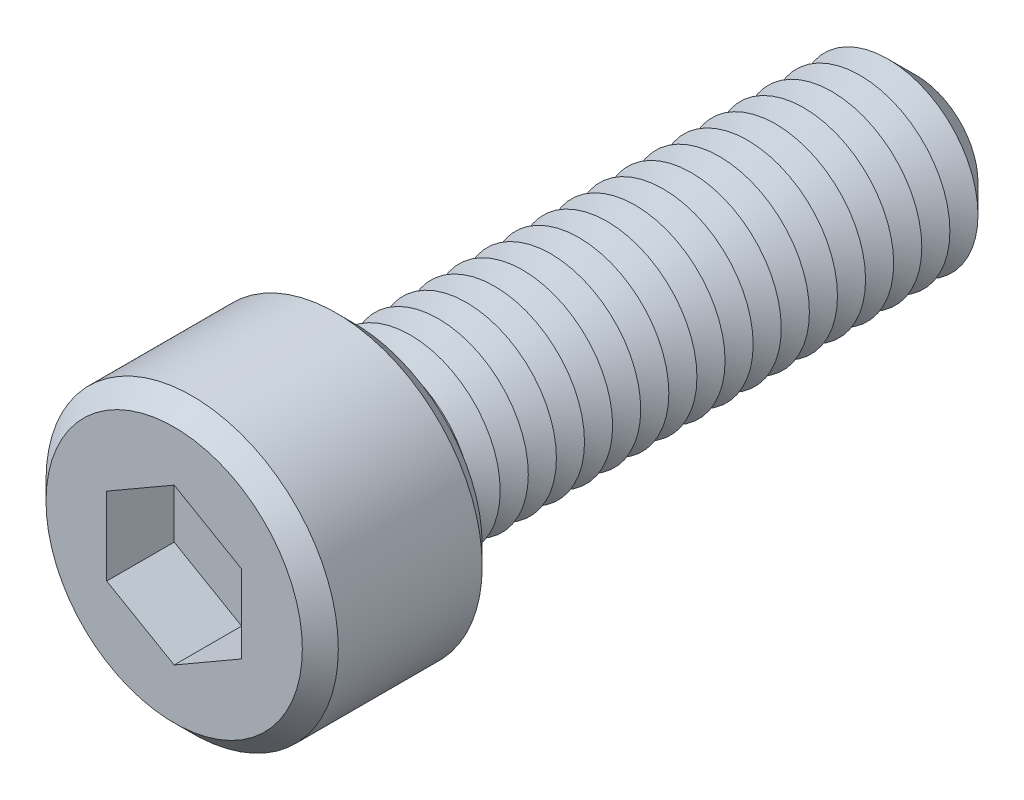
from build123d import *

# Parameters (mm, degrees)
SKETCH1_R           = 6.5
BOSS_EXTRUDE1_DEPTH = 8
SKETCH2_R           = 4
BOSS_EXTRUDE2_DEPTH = 25
CHAMFER1_SIZE       = 1.25
LPATTERN1_COUNT     = 19
LPATTERN1_PITCH     = 1.25
CUT_EXTRUDE1_DEPTH  = 3
SKETCH6_R           = 0.9
CUT_EXTRUDE2_DEPTH  = 30
CHAMFER2_SIZE       = 0.8


with BuildPart() as part:
    # Sketch1 → Boss-Extrude1 (new body)
    with BuildSketch(Plane.XY):
        Circle(SKETCH1_R)
    extrude(amount=BOSS_EXTRUDE1_DEPTH)

    # Sketch2 → Boss-Extrude2 (add)
    with BuildSketch(Plane(origin=(0, 0, 0), x_dir=(-1, 0, 0), z_dir=(0, 0, -1))):
        Circle(SKETCH2_R)
    extrude(amount=BOSS_EXTRUDE2_DEPTH)

    # Chamfer1
    chamfer1_edges = [part.edges().sort_by_distance(p)[0] for p in [
        (4, 0, -25),
    ]]
    chamfer(chamfer1_edges, length=CHAMFER1_SIZE)

    # Sketch4 → Cut-Revolve1 (revolve, cut)
    with BuildSketch(Plane(origin=(0, 0, 0), x_dir=(0, 0, -1), z_dir=(1, 0, 0)), mode=Mode.PRIVATE) as cut_revolve1_sk:
        Polygon((0, 4), (0.625, 2.917468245), (1.25, 4), align=None)
    cut_revolve1 = revolve(cut_revolve1_sk.sketch.rotate(Axis((0, 0, 2.512122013), (0, 0, -1)), 90), axis=Axis((0, 0, 2.512122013), (0, 0, -1)), mode=Mode.SUBTRACT)

    # LPattern1: Cut-Revolve1 ×19
    with Locations(*[(0, 0, -i * LPATTERN1_PITCH) for i in range(1, LPATTERN1_COUNT)]):
        add(cut_revolve1, mode=Mode.SUBTRACT)

    # Sketch5 → Cut-Extrude1 (cut)
    with BuildSketch(Plane.XY.offset(8)):
        Polygon((0, 3.464101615), (-3, 1.732050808), (-3, -1.732050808), (0, -3.464101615), (3, -1.732050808), (3, 1.732050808), align=None)
    extrude(amount=-CUT_EXTRUDE1_DEPTH, mode=Mode.SUBTRACT)

    # Sketch6 → Cut-Extrude2 (cut)
    with BuildSketch(Plane.XY.offset(5)):
        Circle(SKETCH6_R)
    extrude(amount=-CUT_EXTRUDE2_DEPTH, mode=Mode.SUBTRACT)

    # Chamfer2
    chamfer2_edges = [part.edges().sort_by_distance(p)[0] for p in [
        (-6.5, 0, 0),
        (-6.5, 0, 8),
    ]]
    chamfer(chamfer2_edges, length=CHAMFER2_SIZE)


solid = part.part
